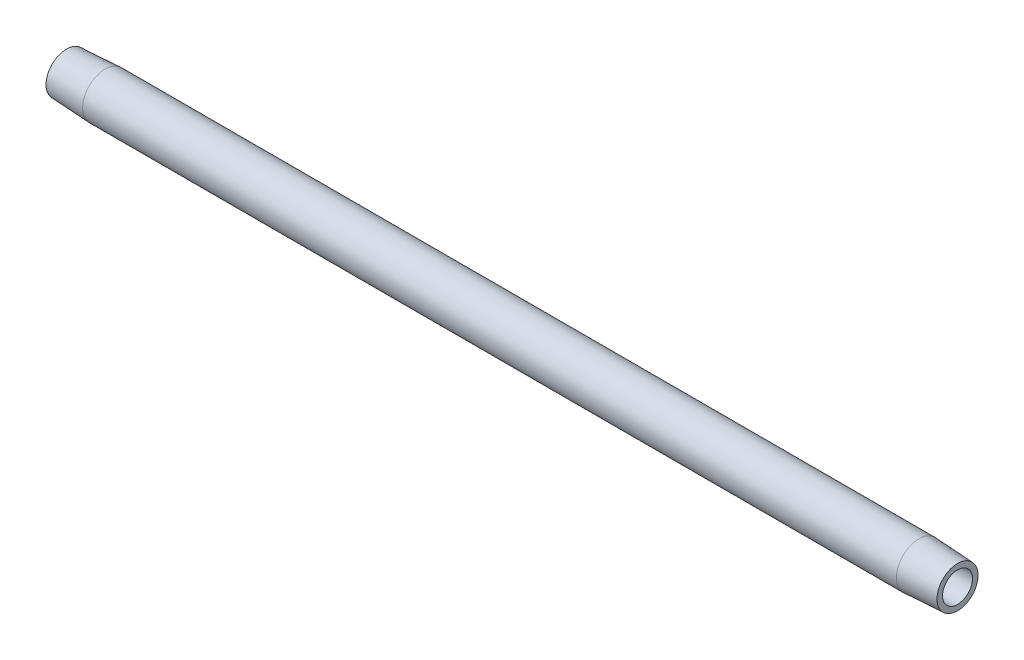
from build123d import *


with BuildPart() as part:
    # Sketch2 → Revolve1 (revolve)
    with BuildSketch(Plane.XY, mode=Mode.PRIVATE) as revolve1_sk:
        Polygon((8.810039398, 5.1435), (0, 4.6817854), (0, 3.4163), (203.2, 3.4163), (203.2, 4.6817854), (194.389960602, 5.1435), align=None)
    revolve(revolve1_sk.sketch.rotate(Axis((0.476141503, 0, 0), (1, 0, 0)), 90), axis=Axis((0.476141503, 0, 0), (1, 0, 0)))


solid = part.part
